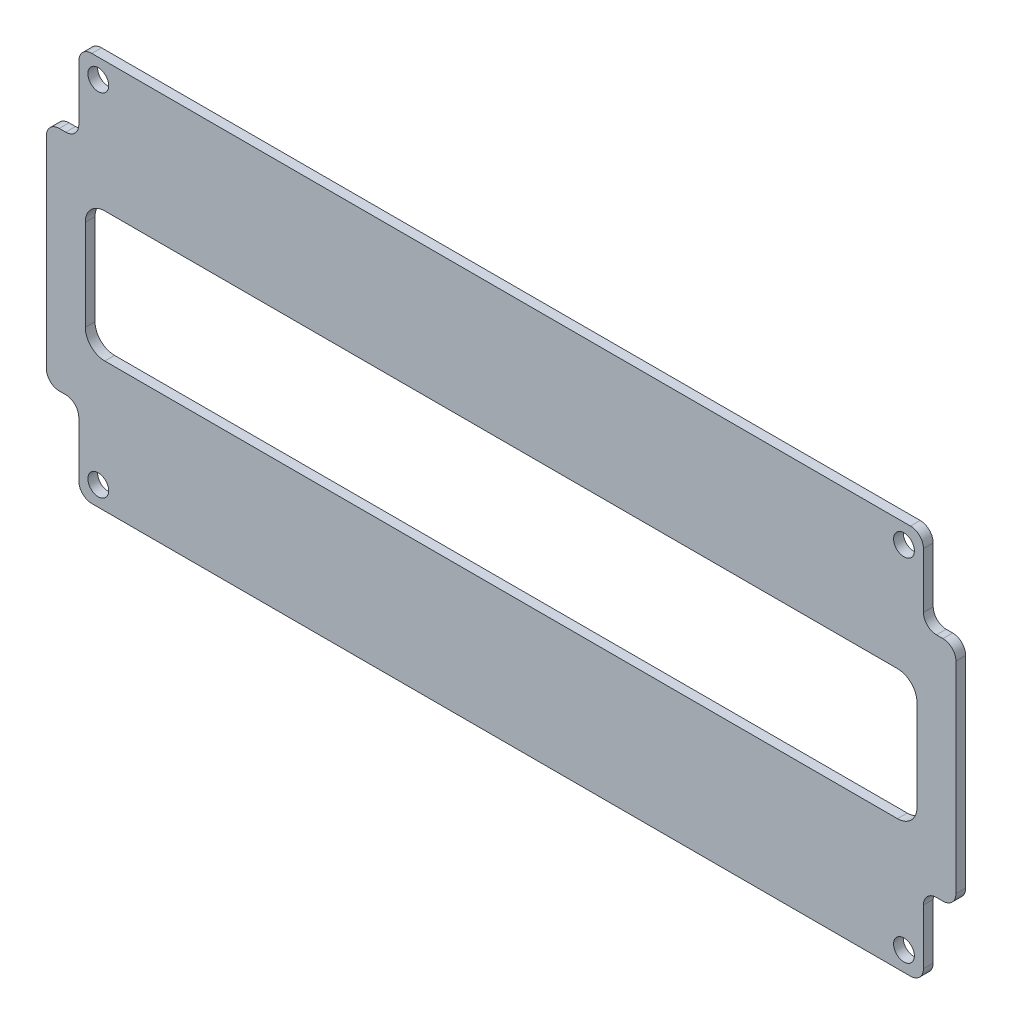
ISO-10303-21;
HEADER;
FILE_DESCRIPTION(('STEP AP214'),'2;1');
FILE_NAME('part.step','',(''),(''),'','','');
FILE_SCHEMA(('AUTOMOTIVE_DESIGN { 1 0 10303 214 1 1 1 1 }'));
ENDSEC;
DATA;
#1=APPLICATION_CONTEXT('core data for automotive mechanical design processes');
#2=APPLICATION_PROTOCOL_DEFINITION('international standard','automotive_design',2000,#1);
#3=PRODUCT_CONTEXT('',#1,'mechanical');
#4=PRODUCT('Part','Part','',(#3));
#5=PRODUCT_RELATED_PRODUCT_CATEGORY('part','',(#4));
#6=PRODUCT_DEFINITION_FORMATION('','',#4);
#7=PRODUCT_DEFINITION_CONTEXT('part definition',#1,'design');
#8=PRODUCT_DEFINITION('design','',#6,#7);
#9=PRODUCT_DEFINITION_SHAPE('','',#8);
#10=(LENGTH_UNIT() NAMED_UNIT(*) SI_UNIT(.MILLI.,.METRE.));
#11=(NAMED_UNIT(*) PLANE_ANGLE_UNIT() SI_UNIT($,.RADIAN.));
#12=(NAMED_UNIT(*) SI_UNIT($,.STERADIAN.) SOLID_ANGLE_UNIT());
#13=UNCERTAINTY_MEASURE_WITH_UNIT(LENGTH_MEASURE(1.E-05),#10,'distance_accuracy_value','');
#14=(GEOMETRIC_REPRESENTATION_CONTEXT(3) GLOBAL_UNCERTAINTY_ASSIGNED_CONTEXT((#13)) GLOBAL_UNIT_ASSIGNED_CONTEXT((#10,
#11,#12)) REPRESENTATION_CONTEXT('',''));
#15=CARTESIAN_POINT('',(0.,0.,0.));
#16=DIRECTION('',(0.,0.,1.));
#17=DIRECTION('',(1.,0.,0.));
#18=AXIS2_PLACEMENT_3D('',#15,#16,#17);
#19=CARTESIAN_POINT('',(63.,-28.,3.));
#20=DIRECTION('',(0.,0.,1.));
#21=DIRECTION('',(1.,0.,0.));
#22=AXIS2_PLACEMENT_3D('',#19,#20,#21);
#23=PLANE('',#22);
#24=CARTESIAN_POINT('',(62.,27.,3.));
#25=DIRECTION('',(0.,0.,1.));
#26=DIRECTION('',(1.,0.,0.));
#27=AXIS2_PLACEMENT_3D('',#24,#25,#26);
#28=CIRCLE('',#27,1.6);
#29=CARTESIAN_POINT('',(63.6,27.,3.));
#30=VERTEX_POINT('',#29);
#31=EDGE_CURVE('E933',#30,#30,#28,.T.);
#32=ORIENTED_EDGE('',*,*,#31,.F.);
#33=EDGE_LOOP('',(#32));
#34=FACE_BOUND('',#33,.T.);
#35=CARTESIAN_POINT('',(-62.,-27.,3.));
#36=DIRECTION('',(0.,0.,1.));
#37=DIRECTION('',(1.,0.,0.));
#38=AXIS2_PLACEMENT_3D('',#35,#36,#37);
#39=CIRCLE('',#38,1.6);
#40=CARTESIAN_POINT('',(-60.4,-27.,3.));
#41=VERTEX_POINT('',#40);
#42=EDGE_CURVE('E277',#41,#41,#39,.T.);
#43=ORIENTED_EDGE('',*,*,#42,.F.);
#44=EDGE_LOOP('',(#43));
#45=FACE_BOUND('',#44,.T.);
#46=CARTESIAN_POINT('',(63.,-28.,3.));
#47=DIRECTION('',(0.,0.,1.));
#48=DIRECTION('',(1.,0.,0.));
#49=AXIS2_PLACEMENT_3D('',#46,#47,#48);
#50=CIRCLE('',#49,1.99999999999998);
#51=CARTESIAN_POINT('',(63.,-30.,3.));
#52=VERTEX_POINT('',#51);
#53=CARTESIAN_POINT('',(64.9999999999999,-28.,3.));
#54=VERTEX_POINT('',#53);
#55=EDGE_CURVE('E307',#52,#54,#50,.T.);
#56=ORIENTED_EDGE('',*,*,#55,.T.);
#57=DIRECTION('',(0.,1.,0.));
#58=VECTOR('',#57,1.);
#59=CARTESIAN_POINT('',(64.9999999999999,-28.,3.));
#60=LINE('',#59,#58);
#61=CARTESIAN_POINT('',(64.9999999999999,-19.5,3.));
#62=VERTEX_POINT('',#61);
#63=EDGE_CURVE('E310',#54,#62,#60,.T.);
#64=ORIENTED_EDGE('',*,*,#63,.T.);
#65=CARTESIAN_POINT('',(67.,-19.5,3.));
#66=DIRECTION('',(0.,0.,-1.));
#67=DIRECTION('',(-1.,0.,0.));
#68=AXIS2_PLACEMENT_3D('',#65,#66,#67);
#69=CIRCLE('',#68,2.00000000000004);
#70=CARTESIAN_POINT('',(66.9999999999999,-17.5,3.));
#71=VERTEX_POINT('',#70);
#72=EDGE_CURVE('E313',#62,#71,#69,.T.);
#73=ORIENTED_EDGE('',*,*,#72,.T.);
#74=DIRECTION('',(1.,0.,0.));
#75=VECTOR('',#74,1.);
#76=CARTESIAN_POINT('',(66.9999999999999,-17.5,3.));
#77=LINE('',#76,#75);
#78=CARTESIAN_POINT('',(68.,-17.5,3.));
#79=VERTEX_POINT('',#78);
#80=EDGE_CURVE('E315',#71,#79,#77,.T.);
#81=ORIENTED_EDGE('',*,*,#80,.T.);
#82=CARTESIAN_POINT('',(68.,-15.5,3.));
#83=DIRECTION('',(0.,0.,1.));
#84=DIRECTION('',(1.,0.,0.));
#85=AXIS2_PLACEMENT_3D('',#82,#83,#84);
#86=CIRCLE('',#85,1.99999999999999);
#87=CARTESIAN_POINT('',(70.,-15.5,3.));
#88=VERTEX_POINT('',#87);
#89=EDGE_CURVE('E317',#79,#88,#86,.T.);
#90=ORIENTED_EDGE('',*,*,#89,.T.);
#91=DIRECTION('',(0.,1.,0.));
#92=VECTOR('',#91,1.);
#93=CARTESIAN_POINT('',(70.,15.5,3.));
#94=LINE('',#93,#92);
#95=CARTESIAN_POINT('',(70.,15.5,3.));
#96=VERTEX_POINT('',#95);
#97=EDGE_CURVE('E319',#88,#96,#94,.T.);
#98=ORIENTED_EDGE('',*,*,#97,.T.);
#99=CARTESIAN_POINT('',(68.,15.5,3.));
#100=DIRECTION('',(0.,0.,1.));
#101=DIRECTION('',(1.,0.,0.));
#102=AXIS2_PLACEMENT_3D('',#99,#100,#101);
#103=CIRCLE('',#102,1.99999999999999);
#104=CARTESIAN_POINT('',(68.,17.5,3.));
#105=VERTEX_POINT('',#104);
#106=EDGE_CURVE('E321',#96,#105,#103,.T.);
#107=ORIENTED_EDGE('',*,*,#106,.T.);
#108=DIRECTION('',(-1.,0.,0.));
#109=VECTOR('',#108,1.);
#110=CARTESIAN_POINT('',(66.9999999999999,17.5,3.));
#111=LINE('',#110,#109);
#112=CARTESIAN_POINT('',(66.9999999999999,17.5,3.));
#113=VERTEX_POINT('',#112);
#114=EDGE_CURVE('E323',#105,#113,#111,.T.);
#115=ORIENTED_EDGE('',*,*,#114,.T.);
#116=CARTESIAN_POINT('',(67.,19.5,3.));
#117=DIRECTION('',(0.,0.,-1.));
#118=DIRECTION('',(1.,0.,0.));
#119=AXIS2_PLACEMENT_3D('',#116,#117,#118);
#120=CIRCLE('',#119,2.00000000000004);
#121=CARTESIAN_POINT('',(64.9999999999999,19.5,3.));
#122=VERTEX_POINT('',#121);
#123=EDGE_CURVE('E325',#113,#122,#120,.T.);
#124=ORIENTED_EDGE('',*,*,#123,.T.);
#125=DIRECTION('',(0.,1.,0.));
#126=VECTOR('',#125,1.);
#127=CARTESIAN_POINT('',(64.9999999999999,28.,3.));
#128=LINE('',#127,#126);
#129=CARTESIAN_POINT('',(65.,28.,3.));
#130=VERTEX_POINT('',#129);
#131=EDGE_CURVE('E327',#122,#130,#128,.T.);
#132=ORIENTED_EDGE('',*,*,#131,.T.);
#133=CARTESIAN_POINT('',(63.,28.,3.));
#134=DIRECTION('',(0.,0.,1.));
#135=DIRECTION('',(-1.,0.,0.));
#136=AXIS2_PLACEMENT_3D('',#133,#134,#135);
#137=CIRCLE('',#136,1.99999999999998);
#138=CARTESIAN_POINT('',(63.,30.,3.));
#139=VERTEX_POINT('',#138);
#140=EDGE_CURVE('E329',#130,#139,#137,.T.);
#141=ORIENTED_EDGE('',*,*,#140,.T.);
#142=DIRECTION('',(-1.,0.,0.));
#143=VECTOR('',#142,1.);
#144=CARTESIAN_POINT('',(-63.,30.,3.));
#145=LINE('',#144,#143);
#146=CARTESIAN_POINT('',(-63.,30.,3.));
#147=VERTEX_POINT('',#146);
#148=EDGE_CURVE('E331',#139,#147,#145,.T.);
#149=ORIENTED_EDGE('',*,*,#148,.T.);
#150=CARTESIAN_POINT('',(-63.,28.,3.));
#151=DIRECTION('',(0.,0.,1.));
#152=DIRECTION('',(1.,0.,0.));
#153=AXIS2_PLACEMENT_3D('',#150,#151,#152);
#154=CIRCLE('',#153,1.99999999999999);
#155=CARTESIAN_POINT('',(-65.,28.,3.));
#156=VERTEX_POINT('',#155);
#157=EDGE_CURVE('E333',#147,#156,#154,.T.);
#158=ORIENTED_EDGE('',*,*,#157,.T.);
#159=DIRECTION('',(0.,-1.,0.));
#160=VECTOR('',#159,1.);
#161=CARTESIAN_POINT('',(-65.,28.,3.));
#162=LINE('',#161,#160);
#163=CARTESIAN_POINT('',(-65.,19.5,3.));
#164=VERTEX_POINT('',#163);
#165=EDGE_CURVE('E335',#156,#164,#162,.T.);
#166=ORIENTED_EDGE('',*,*,#165,.T.);
#167=CARTESIAN_POINT('',(-67.,19.5,3.));
#168=DIRECTION('',(0.,0.,-1.));
#169=DIRECTION('',(-1.,0.,0.));
#170=AXIS2_PLACEMENT_3D('',#167,#168,#169);
#171=CIRCLE('',#170,2.00000000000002);
#172=CARTESIAN_POINT('',(-66.9999999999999,17.5,3.));
#173=VERTEX_POINT('',#172);
#174=EDGE_CURVE('E337',#164,#173,#171,.T.);
#175=ORIENTED_EDGE('',*,*,#174,.T.);
#176=DIRECTION('',(-1.,0.,0.));
#177=VECTOR('',#176,1.);
#178=CARTESIAN_POINT('',(-66.9999999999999,17.5,3.));
#179=LINE('',#178,#177);
#180=CARTESIAN_POINT('',(-68.,17.5,3.));
#181=VERTEX_POINT('',#180);
#182=EDGE_CURVE('E339',#173,#181,#179,.T.);
#183=ORIENTED_EDGE('',*,*,#182,.T.);
#184=CARTESIAN_POINT('',(-68.,15.5,3.));
#185=DIRECTION('',(0.,0.,1.));
#186=DIRECTION('',(-1.,0.,0.));
#187=AXIS2_PLACEMENT_3D('',#184,#185,#186);
#188=CIRCLE('',#187,2.00000000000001);
#189=CARTESIAN_POINT('',(-70.,15.5,3.));
#190=VERTEX_POINT('',#189);
#191=EDGE_CURVE('E341',#181,#190,#188,.T.);
#192=ORIENTED_EDGE('',*,*,#191,.T.);
#193=DIRECTION('',(0.,-1.,0.));
#194=VECTOR('',#193,1.);
#195=CARTESIAN_POINT('',(-70.,15.5,3.));
#196=LINE('',#195,#194);
#197=CARTESIAN_POINT('',(-70.,-15.5,3.));
#198=VERTEX_POINT('',#197);
#199=EDGE_CURVE('E343',#190,#198,#196,.T.);
#200=ORIENTED_EDGE('',*,*,#199,.T.);
#201=CARTESIAN_POINT('',(-68.,-15.5,3.));
#202=DIRECTION('',(0.,0.,1.));
#203=DIRECTION('',(-1.,0.,0.));
#204=AXIS2_PLACEMENT_3D('',#201,#202,#203);
#205=CIRCLE('',#204,2.00000000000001);
#206=CARTESIAN_POINT('',(-68.,-17.5,3.));
#207=VERTEX_POINT('',#206);
#208=EDGE_CURVE('E345',#198,#207,#205,.T.);
#209=ORIENTED_EDGE('',*,*,#208,.T.);
#210=DIRECTION('',(1.,0.,0.));
#211=VECTOR('',#210,1.);
#212=CARTESIAN_POINT('',(-66.9999999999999,-17.5,3.));
#213=LINE('',#212,#211);
#214=CARTESIAN_POINT('',(-66.9999999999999,-17.5,3.));
#215=VERTEX_POINT('',#214);
#216=EDGE_CURVE('E347',#207,#215,#213,.T.);
#217=ORIENTED_EDGE('',*,*,#216,.T.);
#218=CARTESIAN_POINT('',(-67.,-19.5,3.));
#219=DIRECTION('',(0.,0.,-1.));
#220=DIRECTION('',(1.,0.,0.));
#221=AXIS2_PLACEMENT_3D('',#218,#219,#220);
#222=CIRCLE('',#221,2.00000000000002);
#223=CARTESIAN_POINT('',(-65.,-19.5,3.));
#224=VERTEX_POINT('',#223);
#225=EDGE_CURVE('E349',#215,#224,#222,.T.);
#226=ORIENTED_EDGE('',*,*,#225,.T.);
#227=DIRECTION('',(0.,-1.,0.));
#228=VECTOR('',#227,1.);
#229=CARTESIAN_POINT('',(-65.,-28.,3.));
#230=LINE('',#229,#228);
#231=CARTESIAN_POINT('',(-65.,-28.,3.));
#232=VERTEX_POINT('',#231);
#233=EDGE_CURVE('E351',#224,#232,#230,.T.);
#234=ORIENTED_EDGE('',*,*,#233,.T.);
#235=CARTESIAN_POINT('',(-63.,-28.,3.));
#236=DIRECTION('',(0.,0.,1.));
#237=DIRECTION('',(-1.,0.,0.));
#238=AXIS2_PLACEMENT_3D('',#235,#236,#237);
#239=CIRCLE('',#238,1.99999999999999);
#240=CARTESIAN_POINT('',(-63.,-30.,3.));
#241=VERTEX_POINT('',#240);
#242=EDGE_CURVE('E353',#232,#241,#239,.T.);
#243=ORIENTED_EDGE('',*,*,#242,.T.);
#244=DIRECTION('',(1.,0.,0.));
#245=VECTOR('',#244,1.);
#246=CARTESIAN_POINT('',(-63.,-30.,3.));
#247=LINE('',#246,#245);
#248=EDGE_CURVE('E355',#241,#52,#247,.T.);
#249=ORIENTED_EDGE('',*,*,#248,.T.);
#250=EDGE_LOOP('',(#56,#64,#73,#81,#90,#98,#107,#115,#124,#132,#141,#149,#158,#166,#175,#183,
#192,#200,#209,#217,#226,#234,#243,#249));
#251=FACE_BOUND('',#250,.T.);
#252=DIRECTION('',(1.,0.,0.));
#253=VECTOR('',#252,1.);
#254=CARTESIAN_POINT('',(-61.,-10.,3.));
#255=LINE('',#254,#253);
#256=CARTESIAN_POINT('',(-61.,-10.,3.));
#257=VERTEX_POINT('',#256);
#258=CARTESIAN_POINT('',(61.,-9.99999999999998,3.));
#259=VERTEX_POINT('',#258);
#260=EDGE_CURVE('E247',#257,#259,#255,.T.);
#261=ORIENTED_EDGE('',*,*,#260,.F.);
#262=CARTESIAN_POINT('',(-61.,-7.,3.));
#263=DIRECTION('',(0.,0.,1.));
#264=DIRECTION('',(1.,0.,0.));
#265=AXIS2_PLACEMENT_3D('',#262,#263,#264);
#266=CIRCLE('',#265,3.);
#267=CARTESIAN_POINT('',(-64.,-6.99999999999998,3.));
#268=VERTEX_POINT('',#267);
#269=EDGE_CURVE('E239',#268,#257,#266,.T.);
#270=ORIENTED_EDGE('',*,*,#269,.F.);
#271=DIRECTION('',(0.,-1.,0.));
#272=VECTOR('',#271,1.);
#273=CARTESIAN_POINT('',(-64.,6.99999999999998,3.));
#274=LINE('',#273,#272);
#275=CARTESIAN_POINT('',(-64.,6.99999999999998,3.));
#276=VERTEX_POINT('',#275);
#277=EDGE_CURVE('E274',#276,#268,#274,.T.);
#278=ORIENTED_EDGE('',*,*,#277,.F.);
#279=CARTESIAN_POINT('',(-61.,7.,3.));
#280=DIRECTION('',(0.,0.,1.));
#281=DIRECTION('',(1.,0.,0.));
#282=AXIS2_PLACEMENT_3D('',#279,#280,#281);
#283=CIRCLE('',#282,3.);
#284=CARTESIAN_POINT('',(-61.,10.,3.));
#285=VERTEX_POINT('',#284);
#286=EDGE_CURVE('E272',#285,#276,#283,.T.);
#287=ORIENTED_EDGE('',*,*,#286,.F.);
#288=DIRECTION('',(-1.,0.,0.));
#289=VECTOR('',#288,1.);
#290=CARTESIAN_POINT('',(-61.,10.,3.));
#291=LINE('',#290,#289);
#292=CARTESIAN_POINT('',(61.,10.,3.));
#293=VERTEX_POINT('',#292);
#294=EDGE_CURVE('E270',#293,#285,#291,.T.);
#295=ORIENTED_EDGE('',*,*,#294,.F.);
#296=CARTESIAN_POINT('',(61.,7.00000000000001,3.));
#297=DIRECTION('',(0.,0.,1.));
#298=DIRECTION('',(-1.,0.,0.));
#299=AXIS2_PLACEMENT_3D('',#296,#297,#298);
#300=CIRCLE('',#299,3.);
#301=CARTESIAN_POINT('',(64.,6.99999999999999,3.));
#302=VERTEX_POINT('',#301);
#303=EDGE_CURVE('E268',#302,#293,#300,.T.);
#304=ORIENTED_EDGE('',*,*,#303,.F.);
#305=DIRECTION('',(0.,1.,0.));
#306=VECTOR('',#305,1.);
#307=CARTESIAN_POINT('',(64.,6.99999999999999,3.));
#308=LINE('',#307,#306);
#309=CARTESIAN_POINT('',(64.,-6.99999999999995,3.));
#310=VERTEX_POINT('',#309);
#311=EDGE_CURVE('E263',#310,#302,#308,.T.);
#312=ORIENTED_EDGE('',*,*,#311,.F.);
#313=CARTESIAN_POINT('',(61.,-6.99999999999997,3.));
#314=DIRECTION('',(0.,0.,1.));
#315=DIRECTION('',(-1.,0.,0.));
#316=AXIS2_PLACEMENT_3D('',#313,#314,#315);
#317=CIRCLE('',#316,3.00000000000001);
#318=EDGE_CURVE('E261',#259,#310,#317,.T.);
#319=ORIENTED_EDGE('',*,*,#318,.F.);
#320=EDGE_LOOP('',(#261,#270,#278,#287,#295,#304,#312,#319));
#321=FACE_BOUND('',#320,.T.);
#322=CARTESIAN_POINT('',(-62.,27.,3.));
#323=DIRECTION('',(0.,0.,1.));
#324=DIRECTION('',(-1.,0.,0.));
#325=AXIS2_PLACEMENT_3D('',#322,#323,#324);
#326=CIRCLE('',#325,1.6);
#327=CARTESIAN_POINT('',(-63.6,27.,3.));
#328=VERTEX_POINT('',#327);
#329=EDGE_CURVE('E939',#328,#328,#326,.T.);
#330=ORIENTED_EDGE('',*,*,#329,.F.);
#331=EDGE_LOOP('',(#330));
#332=FACE_BOUND('',#331,.T.);
#333=CARTESIAN_POINT('',(62.,-27.,3.));
#334=DIRECTION('',(0.,0.,1.));
#335=DIRECTION('',(-1.,0.,0.));
#336=AXIS2_PLACEMENT_3D('',#333,#334,#335);
#337=CIRCLE('',#336,1.6);
#338=CARTESIAN_POINT('',(60.4,-27.,3.));
#339=VERTEX_POINT('',#338);
#340=EDGE_CURVE('E924',#339,#339,#337,.T.);
#341=ORIENTED_EDGE('',*,*,#340,.F.);
#342=EDGE_LOOP('',(#341));
#343=FACE_BOUND('',#342,.T.);
#344=ADVANCED_FACE('F30',(#34,#45,#251,#321,#332,#343),#23,.T.);
#345=CARTESIAN_POINT('',(63.,-28.,1.5));
#346=DIRECTION('',(0.,0.,1.));
#347=DIRECTION('',(1.,0.,0.));
#348=AXIS2_PLACEMENT_3D('',#345,#346,#347);
#349=PLANE('',#348);
#350=CARTESIAN_POINT('',(63.,-28.,1.5));
#351=DIRECTION('',(0.,0.,1.));
#352=DIRECTION('',(1.,0.,0.));
#353=AXIS2_PLACEMENT_3D('',#350,#351,#352);
#354=CIRCLE('',#353,1.99999999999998);
#355=CARTESIAN_POINT('',(63.,-30.,1.5));
#356=VERTEX_POINT('',#355);
#357=CARTESIAN_POINT('',(64.9999999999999,-28.,1.5));
#358=VERTEX_POINT('',#357);
#359=EDGE_CURVE('E255',#356,#358,#354,.T.);
#360=ORIENTED_EDGE('',*,*,#359,.F.);
#361=DIRECTION('',(1.,0.,0.));
#362=VECTOR('',#361,1.);
#363=CARTESIAN_POINT('',(-63.,-30.,1.5));
#364=LINE('',#363,#362);
#365=CARTESIAN_POINT('',(-63.,-30.,1.5));
#366=VERTEX_POINT('',#365);
#367=EDGE_CURVE('E311',#366,#356,#364,.T.);
#368=ORIENTED_EDGE('',*,*,#367,.F.);
#369=CARTESIAN_POINT('',(-63.,-28.,1.5));
#370=DIRECTION('',(0.,0.,1.));
#371=DIRECTION('',(-1.,0.,0.));
#372=AXIS2_PLACEMENT_3D('',#369,#370,#371);
#373=CIRCLE('',#372,1.99999999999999);
#374=CARTESIAN_POINT('',(-65.,-28.,1.5));
#375=VERTEX_POINT('',#374);
#376=EDGE_CURVE('E402',#375,#366,#373,.T.);
#377=ORIENTED_EDGE('',*,*,#376,.F.);
#378=DIRECTION('',(0.,-1.,0.));
#379=VECTOR('',#378,1.);
#380=CARTESIAN_POINT('',(-65.,-28.,1.5));
#381=LINE('',#380,#379);
#382=CARTESIAN_POINT('',(-65.,-19.5,1.5));
#383=VERTEX_POINT('',#382);
#384=EDGE_CURVE('E400',#383,#375,#381,.T.);
#385=ORIENTED_EDGE('',*,*,#384,.F.);
#386=CARTESIAN_POINT('',(-67.,-19.5,1.5));
#387=DIRECTION('',(0.,0.,-1.));
#388=DIRECTION('',(1.,0.,0.));
#389=AXIS2_PLACEMENT_3D('',#386,#387,#388);
#390=CIRCLE('',#389,2.00000000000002);
#391=CARTESIAN_POINT('',(-66.9999999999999,-17.5,1.5));
#392=VERTEX_POINT('',#391);
#393=EDGE_CURVE('E398',#392,#383,#390,.T.);
#394=ORIENTED_EDGE('',*,*,#393,.F.);
#395=DIRECTION('',(1.,0.,0.));
#396=VECTOR('',#395,1.);
#397=CARTESIAN_POINT('',(-66.9999999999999,-17.5,1.5));
#398=LINE('',#397,#396);
#399=CARTESIAN_POINT('',(-68.,-17.5,1.5));
#400=VERTEX_POINT('',#399);
#401=EDGE_CURVE('E396',#400,#392,#398,.T.);
#402=ORIENTED_EDGE('',*,*,#401,.F.);
#403=CARTESIAN_POINT('',(-68.,-15.5,1.5));
#404=DIRECTION('',(0.,0.,1.));
#405=DIRECTION('',(-1.,0.,0.));
#406=AXIS2_PLACEMENT_3D('',#403,#404,#405);
#407=CIRCLE('',#406,2.00000000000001);
#408=CARTESIAN_POINT('',(-70.,-15.5,1.5));
#409=VERTEX_POINT('',#408);
#410=EDGE_CURVE('E394',#409,#400,#407,.T.);
#411=ORIENTED_EDGE('',*,*,#410,.F.);
#412=DIRECTION('',(0.,-1.,0.));
#413=VECTOR('',#412,1.);
#414=CARTESIAN_POINT('',(-70.,15.5,1.5));
#415=LINE('',#414,#413);
#416=CARTESIAN_POINT('',(-70.,15.5,1.5));
#417=VERTEX_POINT('',#416);
#418=EDGE_CURVE('E392',#417,#409,#415,.T.);
#419=ORIENTED_EDGE('',*,*,#418,.F.);
#420=CARTESIAN_POINT('',(-68.,15.5,1.5));
#421=DIRECTION('',(0.,0.,1.));
#422=DIRECTION('',(-1.,0.,0.));
#423=AXIS2_PLACEMENT_3D('',#420,#421,#422);
#424=CIRCLE('',#423,2.00000000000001);
#425=CARTESIAN_POINT('',(-68.,17.5,1.5));
#426=VERTEX_POINT('',#425);
#427=EDGE_CURVE('E390',#426,#417,#424,.T.);
#428=ORIENTED_EDGE('',*,*,#427,.F.);
#429=DIRECTION('',(-1.,0.,0.));
#430=VECTOR('',#429,1.);
#431=CARTESIAN_POINT('',(-66.9999999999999,17.5,1.5));
#432=LINE('',#431,#430);
#433=CARTESIAN_POINT('',(-66.9999999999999,17.5,1.5));
#434=VERTEX_POINT('',#433);
#435=EDGE_CURVE('E388',#434,#426,#432,.T.);
#436=ORIENTED_EDGE('',*,*,#435,.F.);
#437=CARTESIAN_POINT('',(-67.,19.5,1.5));
#438=DIRECTION('',(0.,0.,-1.));
#439=DIRECTION('',(-1.,0.,0.));
#440=AXIS2_PLACEMENT_3D('',#437,#438,#439);
#441=CIRCLE('',#440,2.00000000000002);
#442=CARTESIAN_POINT('',(-65.,19.5,1.5));
#443=VERTEX_POINT('',#442);
#444=EDGE_CURVE('E386',#443,#434,#441,.T.);
#445=ORIENTED_EDGE('',*,*,#444,.F.);
#446=DIRECTION('',(0.,-1.,0.));
#447=VECTOR('',#446,1.);
#448=CARTESIAN_POINT('',(-65.,28.,1.5));
#449=LINE('',#448,#447);
#450=CARTESIAN_POINT('',(-65.,28.,1.5));
#451=VERTEX_POINT('',#450);
#452=EDGE_CURVE('E384',#451,#443,#449,.T.);
#453=ORIENTED_EDGE('',*,*,#452,.F.);
#454=CARTESIAN_POINT('',(-63.,28.,1.5));
#455=DIRECTION('',(0.,0.,1.));
#456=DIRECTION('',(1.,0.,0.));
#457=AXIS2_PLACEMENT_3D('',#454,#455,#456);
#458=CIRCLE('',#457,1.99999999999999);
#459=CARTESIAN_POINT('',(-63.,30.,1.5));
#460=VERTEX_POINT('',#459);
#461=EDGE_CURVE('E382',#460,#451,#458,.T.);
#462=ORIENTED_EDGE('',*,*,#461,.F.);
#463=DIRECTION('',(-1.,0.,0.));
#464=VECTOR('',#463,1.);
#465=CARTESIAN_POINT('',(-63.,30.,1.5));
#466=LINE('',#465,#464);
#467=CARTESIAN_POINT('',(63.,30.,1.5));
#468=VERTEX_POINT('',#467);
#469=EDGE_CURVE('E380',#468,#460,#466,.T.);
#470=ORIENTED_EDGE('',*,*,#469,.F.);
#471=CARTESIAN_POINT('',(63.,28.,1.5));
#472=DIRECTION('',(0.,0.,1.));
#473=DIRECTION('',(-1.,0.,0.));
#474=AXIS2_PLACEMENT_3D('',#471,#472,#473);
#475=CIRCLE('',#474,1.99999999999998);
#476=CARTESIAN_POINT('',(65.,28.,1.5));
#477=VERTEX_POINT('',#476);
#478=EDGE_CURVE('E378',#477,#468,#475,.T.);
#479=ORIENTED_EDGE('',*,*,#478,.F.);
#480=DIRECTION('',(0.,1.,0.));
#481=VECTOR('',#480,1.);
#482=CARTESIAN_POINT('',(64.9999999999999,28.,1.5));
#483=LINE('',#482,#481);
#484=CARTESIAN_POINT('',(64.9999999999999,19.5,1.5));
#485=VERTEX_POINT('',#484);
#486=EDGE_CURVE('E376',#485,#477,#483,.T.);
#487=ORIENTED_EDGE('',*,*,#486,.F.);
#488=CARTESIAN_POINT('',(67.,19.5,1.5));
#489=DIRECTION('',(0.,0.,-1.));
#490=DIRECTION('',(1.,0.,0.));
#491=AXIS2_PLACEMENT_3D('',#488,#489,#490);
#492=CIRCLE('',#491,2.00000000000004);
#493=CARTESIAN_POINT('',(66.9999999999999,17.5,1.5));
#494=VERTEX_POINT('',#493);
#495=EDGE_CURVE('E374',#494,#485,#492,.T.);
#496=ORIENTED_EDGE('',*,*,#495,.F.);
#497=DIRECTION('',(-1.,0.,0.));
#498=VECTOR('',#497,1.);
#499=CARTESIAN_POINT('',(66.9999999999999,17.5,1.5));
#500=LINE('',#499,#498);
#501=CARTESIAN_POINT('',(68.,17.5,1.5));
#502=VERTEX_POINT('',#501);
#503=EDGE_CURVE('E372',#502,#494,#500,.T.);
#504=ORIENTED_EDGE('',*,*,#503,.F.);
#505=CARTESIAN_POINT('',(68.,15.5,1.5));
#506=DIRECTION('',(0.,0.,1.));
#507=DIRECTION('',(1.,0.,0.));
#508=AXIS2_PLACEMENT_3D('',#505,#506,#507);
#509=CIRCLE('',#508,1.99999999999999);
#510=CARTESIAN_POINT('',(70.,15.5,1.5));
#511=VERTEX_POINT('',#510);
#512=EDGE_CURVE('E370',#511,#502,#509,.T.);
#513=ORIENTED_EDGE('',*,*,#512,.F.);
#514=DIRECTION('',(0.,1.,0.));
#515=VECTOR('',#514,1.);
#516=CARTESIAN_POINT('',(70.,15.5,1.5));
#517=LINE('',#516,#515);
#518=CARTESIAN_POINT('',(70.,-15.5,1.5));
#519=VERTEX_POINT('',#518);
#520=EDGE_CURVE('E368',#519,#511,#517,.T.);
#521=ORIENTED_EDGE('',*,*,#520,.F.);
#522=CARTESIAN_POINT('',(68.,-15.5,1.5));
#523=DIRECTION('',(0.,0.,1.));
#524=DIRECTION('',(1.,0.,0.));
#525=AXIS2_PLACEMENT_3D('',#522,#523,#524);
#526=CIRCLE('',#525,1.99999999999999);
#527=CARTESIAN_POINT('',(68.,-17.5,1.5));
#528=VERTEX_POINT('',#527);
#529=EDGE_CURVE('E366',#528,#519,#526,.T.);
#530=ORIENTED_EDGE('',*,*,#529,.F.);
#531=DIRECTION('',(1.,0.,0.));
#532=VECTOR('',#531,1.);
#533=CARTESIAN_POINT('',(66.9999999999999,-17.5,1.5));
#534=LINE('',#533,#532);
#535=CARTESIAN_POINT('',(66.9999999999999,-17.5,1.5));
#536=VERTEX_POINT('',#535);
#537=EDGE_CURVE('E364',#536,#528,#534,.T.);
#538=ORIENTED_EDGE('',*,*,#537,.F.);
#539=CARTESIAN_POINT('',(67.,-19.5,1.5));
#540=DIRECTION('',(0.,0.,-1.));
#541=DIRECTION('',(-1.,0.,0.));
#542=AXIS2_PLACEMENT_3D('',#539,#540,#541);
#543=CIRCLE('',#542,2.00000000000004);
#544=CARTESIAN_POINT('',(64.9999999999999,-19.5,1.5));
#545=VERTEX_POINT('',#544);
#546=EDGE_CURVE('E362',#545,#536,#543,.T.);
#547=ORIENTED_EDGE('',*,*,#546,.F.);
#548=DIRECTION('',(0.,1.,0.));
#549=VECTOR('',#548,1.);
#550=CARTESIAN_POINT('',(64.9999999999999,-28.,1.5));
#551=LINE('',#550,#549);
#552=EDGE_CURVE('E360',#358,#545,#551,.T.);
#553=ORIENTED_EDGE('',*,*,#552,.F.);
#554=EDGE_LOOP('',(#360,#368,#377,#385,#394,#402,#411,#419,#428,#436,#445,#453,#462,#470,#479,
#487,#496,#504,#513,#521,#530,#538,#547,#553));
#555=FACE_BOUND('',#554,.T.);
#556=CARTESIAN_POINT('',(-61.,-7.,1.5));
#557=DIRECTION('',(0.,0.,1.));
#558=DIRECTION('',(1.,0.,0.));
#559=AXIS2_PLACEMENT_3D('',#556,#557,#558);
#560=CIRCLE('',#559,3.);
#561=CARTESIAN_POINT('',(-64.,-6.99999999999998,1.5));
#562=VERTEX_POINT('',#561);
#563=CARTESIAN_POINT('',(-61.,-10.,1.5));
#564=VERTEX_POINT('',#563);
#565=EDGE_CURVE('E53',#562,#564,#560,.T.);
#566=ORIENTED_EDGE('',*,*,#565,.T.);
#567=DIRECTION('',(1.,0.,0.));
#568=VECTOR('',#567,1.);
#569=CARTESIAN_POINT('',(-61.,-10.,1.5));
#570=LINE('',#569,#568);
#571=CARTESIAN_POINT('',(61.,-9.99999999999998,1.5));
#572=VERTEX_POINT('',#571);
#573=EDGE_CURVE('E254',#564,#572,#570,.T.);
#574=ORIENTED_EDGE('',*,*,#573,.T.);
#575=CARTESIAN_POINT('',(61.,-6.99999999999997,1.5));
#576=DIRECTION('',(0.,0.,1.));
#577=DIRECTION('',(-1.,0.,0.));
#578=AXIS2_PLACEMENT_3D('',#575,#576,#577);
#579=CIRCLE('',#578,3.00000000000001);
#580=CARTESIAN_POINT('',(64.,-6.99999999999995,1.5));
#581=VERTEX_POINT('',#580);
#582=EDGE_CURVE('E279',#572,#581,#579,.T.);
#583=ORIENTED_EDGE('',*,*,#582,.T.);
#584=DIRECTION('',(0.,1.,0.));
#585=VECTOR('',#584,1.);
#586=CARTESIAN_POINT('',(64.,6.99999999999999,1.5));
#587=LINE('',#586,#585);
#588=CARTESIAN_POINT('',(64.,6.99999999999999,1.5));
#589=VERTEX_POINT('',#588);
#590=EDGE_CURVE('E282',#581,#589,#587,.T.);
#591=ORIENTED_EDGE('',*,*,#590,.T.);
#592=CARTESIAN_POINT('',(61.,7.00000000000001,1.5));
#593=DIRECTION('',(0.,0.,1.));
#594=DIRECTION('',(-1.,0.,0.));
#595=AXIS2_PLACEMENT_3D('',#592,#593,#594);
#596=CIRCLE('',#595,3.);
#597=CARTESIAN_POINT('',(61.,10.,1.5));
#598=VERTEX_POINT('',#597);
#599=EDGE_CURVE('E285',#589,#598,#596,.T.);
#600=ORIENTED_EDGE('',*,*,#599,.T.);
#601=DIRECTION('',(-1.,0.,0.));
#602=VECTOR('',#601,1.);
#603=CARTESIAN_POINT('',(-61.,10.,1.5));
#604=LINE('',#603,#602);
#605=CARTESIAN_POINT('',(-61.,10.,1.5));
#606=VERTEX_POINT('',#605);
#607=EDGE_CURVE('E288',#598,#606,#604,.T.);
#608=ORIENTED_EDGE('',*,*,#607,.T.);
#609=CARTESIAN_POINT('',(-61.,7.,1.5));
#610=DIRECTION('',(0.,0.,1.));
#611=DIRECTION('',(1.,0.,0.));
#612=AXIS2_PLACEMENT_3D('',#609,#610,#611);
#613=CIRCLE('',#612,3.);
#614=CARTESIAN_POINT('',(-64.,6.99999999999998,1.5));
#615=VERTEX_POINT('',#614);
#616=EDGE_CURVE('E291',#606,#615,#613,.T.);
#617=ORIENTED_EDGE('',*,*,#616,.T.);
#618=DIRECTION('',(0.,-1.,0.));
#619=VECTOR('',#618,1.);
#620=CARTESIAN_POINT('',(-64.,6.99999999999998,1.5));
#621=LINE('',#620,#619);
#622=EDGE_CURVE('E248',#615,#562,#621,.T.);
#623=ORIENTED_EDGE('',*,*,#622,.T.);
#624=EDGE_LOOP('',(#566,#574,#583,#591,#600,#608,#617,#623));
#625=FACE_BOUND('',#624,.T.);
#626=CARTESIAN_POINT('',(-62.,-27.,1.5));
#627=DIRECTION('',(0.,0.,1.));
#628=DIRECTION('',(1.,0.,0.));
#629=AXIS2_PLACEMENT_3D('',#626,#627,#628);
#630=CIRCLE('',#629,1.6);
#631=CARTESIAN_POINT('',(-60.4,-27.,1.5));
#632=VERTEX_POINT('',#631);
#633=EDGE_CURVE('E942',#632,#632,#630,.T.);
#634=ORIENTED_EDGE('',*,*,#633,.T.);
#635=EDGE_LOOP('',(#634));
#636=FACE_BOUND('',#635,.T.);
#637=CARTESIAN_POINT('',(-62.,27.,1.5));
#638=DIRECTION('',(0.,0.,1.));
#639=DIRECTION('',(-1.,0.,0.));
#640=AXIS2_PLACEMENT_3D('',#637,#638,#639);
#641=CIRCLE('',#640,1.6);
#642=CARTESIAN_POINT('',(-63.6,27.,1.5));
#643=VERTEX_POINT('',#642);
#644=EDGE_CURVE('E936',#643,#643,#641,.T.);
#645=ORIENTED_EDGE('',*,*,#644,.T.);
#646=EDGE_LOOP('',(#645));
#647=FACE_BOUND('',#646,.T.);
#648=CARTESIAN_POINT('',(62.,27.,1.5));
#649=DIRECTION('',(0.,0.,1.));
#650=DIRECTION('',(1.,0.,0.));
#651=AXIS2_PLACEMENT_3D('',#648,#649,#650);
#652=CIRCLE('',#651,1.6);
#653=CARTESIAN_POINT('',(63.6,27.,1.5));
#654=VERTEX_POINT('',#653);
#655=EDGE_CURVE('E930',#654,#654,#652,.T.);
#656=ORIENTED_EDGE('',*,*,#655,.T.);
#657=EDGE_LOOP('',(#656));
#658=FACE_BOUND('',#657,.T.);
#659=CARTESIAN_POINT('',(62.,-27.,1.5));
#660=DIRECTION('',(0.,0.,1.));
#661=DIRECTION('',(-1.,0.,0.));
#662=AXIS2_PLACEMENT_3D('',#659,#660,#661);
#663=CIRCLE('',#662,1.6);
#664=CARTESIAN_POINT('',(60.4,-27.,1.5));
#665=VERTEX_POINT('',#664);
#666=EDGE_CURVE('E927',#665,#665,#663,.T.);
#667=ORIENTED_EDGE('',*,*,#666,.T.);
#668=EDGE_LOOP('',(#667));
#669=FACE_BOUND('',#668,.T.);
#670=ADVANCED_FACE('F480',(#555,#625,#636,#647,#658,#669),#349,.F.);
#671=CARTESIAN_POINT('',(63.,-28.,3.));
#672=DIRECTION('',(0.,0.,-1.));
#673=DIRECTION('',(-1.,0.,0.));
#674=AXIS2_PLACEMENT_3D('',#671,#672,#673);
#675=CYLINDRICAL_SURFACE('',#674,1.99999999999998);
#676=ORIENTED_EDGE('',*,*,#359,.T.);
#677=DIRECTION('',(0.,0.,-1.));
#678=VECTOR('',#677,1.);
#679=CARTESIAN_POINT('',(64.9999999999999,-28.,3.));
#680=LINE('',#679,#678);
#681=EDGE_CURVE('E11',#54,#358,#680,.T.);
#682=ORIENTED_EDGE('',*,*,#681,.F.);
#683=ORIENTED_EDGE('',*,*,#55,.F.);
#684=DIRECTION('',(0.,0.,-1.));
#685=VECTOR('',#684,1.);
#686=CARTESIAN_POINT('',(63.,-30.,3.));
#687=LINE('',#686,#685);
#688=EDGE_CURVE('E357',#52,#356,#687,.T.);
#689=ORIENTED_EDGE('',*,*,#688,.T.);
#690=EDGE_LOOP('',(#676,#682,#683,#689));
#691=FACE_BOUND('',#690,.T.);
#692=ADVANCED_FACE('F32',(#691),#675,.T.);
#693=CARTESIAN_POINT('',(64.9999999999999,-28.,3.));
#694=DIRECTION('',(-1.,0.,0.));
#695=DIRECTION('',(0.,0.,1.));
#696=AXIS2_PLACEMENT_3D('',#693,#694,#695);
#697=PLANE('',#696);
#698=ORIENTED_EDGE('',*,*,#552,.T.);
#699=DIRECTION('',(0.,0.,-1.));
#700=VECTOR('',#699,1.);
#701=CARTESIAN_POINT('',(64.9999999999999,-19.5,3.));
#702=LINE('',#701,#700);
#703=EDGE_CURVE('E38',#62,#545,#702,.T.);
#704=ORIENTED_EDGE('',*,*,#703,.F.);
#705=ORIENTED_EDGE('',*,*,#63,.F.);
#706=ORIENTED_EDGE('',*,*,#681,.T.);
#707=EDGE_LOOP('',(#698,#704,#705,#706));
#708=FACE_BOUND('',#707,.T.);
#709=ADVANCED_FACE('F497',(#708),#697,.F.);
#710=CARTESIAN_POINT('',(67.,-19.5,3.));
#711=DIRECTION('',(0.,0.,-1.));
#712=DIRECTION('',(-1.,0.,0.));
#713=AXIS2_PLACEMENT_3D('',#710,#711,#712);
#714=CYLINDRICAL_SURFACE('',#713,2.00000000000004);
#715=ORIENTED_EDGE('',*,*,#546,.T.);
#716=DIRECTION('',(0.,0.,-1.));
#717=VECTOR('',#716,1.);
#718=CARTESIAN_POINT('',(66.9999999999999,-17.5,3.));
#719=LINE('',#718,#717);
#720=EDGE_CURVE('E467',#71,#536,#719,.T.);
#721=ORIENTED_EDGE('',*,*,#720,.F.);
#722=ORIENTED_EDGE('',*,*,#72,.F.);
#723=ORIENTED_EDGE('',*,*,#703,.T.);
#724=EDGE_LOOP('',(#715,#721,#722,#723));
#725=FACE_BOUND('',#724,.T.);
#726=ADVANCED_FACE('F474',(#725),#714,.F.);
#727=CARTESIAN_POINT('',(66.9999999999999,-17.5,3.));
#728=DIRECTION('',(0.,1.,0.));
#729=DIRECTION('',(-1.,0.,0.));
#730=AXIS2_PLACEMENT_3D('',#727,#728,#729);
#731=PLANE('',#730);
#732=ORIENTED_EDGE('',*,*,#537,.T.);
#733=DIRECTION('',(0.,0.,-1.));
#734=VECTOR('',#733,1.);
#735=CARTESIAN_POINT('',(68.,-17.5,3.));
#736=LINE('',#735,#734);
#737=EDGE_CURVE('E464',#79,#528,#736,.T.);
#738=ORIENTED_EDGE('',*,*,#737,.F.);
#739=ORIENTED_EDGE('',*,*,#80,.F.);
#740=ORIENTED_EDGE('',*,*,#720,.T.);
#741=EDGE_LOOP('',(#732,#738,#739,#740));
#742=FACE_BOUND('',#741,.T.);
#743=ADVANCED_FACE('F486',(#742),#731,.F.);
#744=CARTESIAN_POINT('',(68.,-15.5,3.));
#745=DIRECTION('',(0.,0.,-1.));
#746=DIRECTION('',(-1.,0.,0.));
#747=AXIS2_PLACEMENT_3D('',#744,#745,#746);
#748=CYLINDRICAL_SURFACE('',#747,1.99999999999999);
#749=ORIENTED_EDGE('',*,*,#529,.T.);
#750=DIRECTION('',(0.,0.,-1.));
#751=VECTOR('',#750,1.);
#752=CARTESIAN_POINT('',(70.,-15.5,3.));
#753=LINE('',#752,#751);
#754=EDGE_CURVE('E461',#88,#519,#753,.T.);
#755=ORIENTED_EDGE('',*,*,#754,.F.);
#756=ORIENTED_EDGE('',*,*,#89,.F.);
#757=ORIENTED_EDGE('',*,*,#737,.T.);
#758=EDGE_LOOP('',(#749,#755,#756,#757));
#759=FACE_BOUND('',#758,.T.);
#760=ADVANCED_FACE('F490',(#759),#748,.T.);
#761=CARTESIAN_POINT('',(70.,15.5,3.));
#762=DIRECTION('',(-1.,0.,0.));
#763=DIRECTION('',(0.,0.,1.));
#764=AXIS2_PLACEMENT_3D('',#761,#762,#763);
#765=PLANE('',#764);
#766=ORIENTED_EDGE('',*,*,#520,.T.);
#767=DIRECTION('',(0.,0.,-1.));
#768=VECTOR('',#767,1.);
#769=CARTESIAN_POINT('',(70.,15.5,3.));
#770=LINE('',#769,#768);
#771=EDGE_CURVE('E458',#96,#511,#770,.T.);
#772=ORIENTED_EDGE('',*,*,#771,.F.);
#773=ORIENTED_EDGE('',*,*,#97,.F.);
#774=ORIENTED_EDGE('',*,*,#754,.T.);
#775=EDGE_LOOP('',(#766,#772,#773,#774));
#776=FACE_BOUND('',#775,.T.);
#777=ADVANCED_FACE('F590',(#776),#765,.F.);
#778=CARTESIAN_POINT('',(68.,15.5,3.));
#779=DIRECTION('',(0.,0.,-1.));
#780=DIRECTION('',(-1.,0.,0.));
#781=AXIS2_PLACEMENT_3D('',#778,#779,#780);
#782=CYLINDRICAL_SURFACE('',#781,1.99999999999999);
#783=ORIENTED_EDGE('',*,*,#512,.T.);
#784=DIRECTION('',(0.,0.,-1.));
#785=VECTOR('',#784,1.);
#786=CARTESIAN_POINT('',(68.,17.5,3.));
#787=LINE('',#786,#785);
#788=EDGE_CURVE('E455',#105,#502,#787,.T.);
#789=ORIENTED_EDGE('',*,*,#788,.F.);
#790=ORIENTED_EDGE('',*,*,#106,.F.);
#791=ORIENTED_EDGE('',*,*,#771,.T.);
#792=EDGE_LOOP('',(#783,#789,#790,#791));
#793=FACE_BOUND('',#792,.T.);
#794=ADVANCED_FACE('F588',(#793),#782,.T.);
#795=CARTESIAN_POINT('',(66.9999999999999,17.5,3.));
#796=DIRECTION('',(0.,-1.,0.));
#797=DIRECTION('',(1.,0.,0.));
#798=AXIS2_PLACEMENT_3D('',#795,#796,#797);
#799=PLANE('',#798);
#800=ORIENTED_EDGE('',*,*,#503,.T.);
#801=DIRECTION('',(0.,0.,-1.));
#802=VECTOR('',#801,1.);
#803=CARTESIAN_POINT('',(66.9999999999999,17.5,3.));
#804=LINE('',#803,#802);
#805=EDGE_CURVE('E452',#113,#494,#804,.T.);
#806=ORIENTED_EDGE('',*,*,#805,.F.);
#807=ORIENTED_EDGE('',*,*,#114,.F.);
#808=ORIENTED_EDGE('',*,*,#788,.T.);
#809=EDGE_LOOP('',(#800,#806,#807,#808));
#810=FACE_BOUND('',#809,.T.);
#811=ADVANCED_FACE('F584',(#810),#799,.F.);
#812=CARTESIAN_POINT('',(67.,19.5,3.));
#813=DIRECTION('',(0.,0.,-1.));
#814=DIRECTION('',(-1.,0.,0.));
#815=AXIS2_PLACEMENT_3D('',#812,#813,#814);
#816=CYLINDRICAL_SURFACE('',#815,2.00000000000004);
#817=ORIENTED_EDGE('',*,*,#495,.T.);
#818=DIRECTION('',(0.,0.,-1.));
#819=VECTOR('',#818,1.);
#820=CARTESIAN_POINT('',(64.9999999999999,19.5,3.));
#821=LINE('',#820,#819);
#822=EDGE_CURVE('E449',#122,#485,#821,.T.);
#823=ORIENTED_EDGE('',*,*,#822,.F.);
#824=ORIENTED_EDGE('',*,*,#123,.F.);
#825=ORIENTED_EDGE('',*,*,#805,.T.);
#826=EDGE_LOOP('',(#817,#823,#824,#825));
#827=FACE_BOUND('',#826,.T.);
#828=ADVANCED_FACE('F579',(#827),#816,.F.);
#829=CARTESIAN_POINT('',(64.9999999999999,28.,3.));
#830=DIRECTION('',(-1.,0.,0.));
#831=DIRECTION('',(0.,0.,1.));
#832=AXIS2_PLACEMENT_3D('',#829,#830,#831);
#833=PLANE('',#832);
#834=ORIENTED_EDGE('',*,*,#486,.T.);
#835=DIRECTION('',(0.,0.,-1.));
#836=VECTOR('',#835,1.);
#837=CARTESIAN_POINT('',(65.,28.,3.));
#838=LINE('',#837,#836);
#839=EDGE_CURVE('E446',#130,#477,#838,.T.);
#840=ORIENTED_EDGE('',*,*,#839,.F.);
#841=ORIENTED_EDGE('',*,*,#131,.F.);
#842=ORIENTED_EDGE('',*,*,#822,.T.);
#843=EDGE_LOOP('',(#834,#840,#841,#842));
#844=FACE_BOUND('',#843,.T.);
#845=ADVANCED_FACE('F573',(#844),#833,.F.);
#846=CARTESIAN_POINT('',(63.,28.,3.));
#847=DIRECTION('',(0.,0.,-1.));
#848=DIRECTION('',(-1.,0.,0.));
#849=AXIS2_PLACEMENT_3D('',#846,#847,#848);
#850=CYLINDRICAL_SURFACE('',#849,1.99999999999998);
#851=ORIENTED_EDGE('',*,*,#478,.T.);
#852=DIRECTION('',(0.,0.,-1.));
#853=VECTOR('',#852,1.);
#854=CARTESIAN_POINT('',(63.,30.,3.));
#855=LINE('',#854,#853);
#856=EDGE_CURVE('E443',#139,#468,#855,.T.);
#857=ORIENTED_EDGE('',*,*,#856,.F.);
#858=ORIENTED_EDGE('',*,*,#140,.F.);
#859=ORIENTED_EDGE('',*,*,#839,.T.);
#860=EDGE_LOOP('',(#851,#857,#858,#859));
#861=FACE_BOUND('',#860,.T.);
#862=ADVANCED_FACE('F569',(#861),#850,.T.);
#863=CARTESIAN_POINT('',(-63.,30.,3.));
#864=DIRECTION('',(0.,-1.,0.));
#865=DIRECTION('',(1.,0.,0.));
#866=AXIS2_PLACEMENT_3D('',#863,#864,#865);
#867=PLANE('',#866);
#868=ORIENTED_EDGE('',*,*,#469,.T.);
#869=DIRECTION('',(0.,0.,-1.));
#870=VECTOR('',#869,1.);
#871=CARTESIAN_POINT('',(-63.,30.,3.));
#872=LINE('',#871,#870);
#873=EDGE_CURVE('E440',#147,#460,#872,.T.);
#874=ORIENTED_EDGE('',*,*,#873,.F.);
#875=ORIENTED_EDGE('',*,*,#148,.F.);
#876=ORIENTED_EDGE('',*,*,#856,.T.);
#877=EDGE_LOOP('',(#868,#874,#875,#876));
#878=FACE_BOUND('',#877,.T.);
#879=ADVANCED_FACE('F564',(#878),#867,.F.);
#880=CARTESIAN_POINT('',(-63.,28.,3.));
#881=DIRECTION('',(0.,0.,-1.));
#882=DIRECTION('',(-1.,0.,0.));
#883=AXIS2_PLACEMENT_3D('',#880,#881,#882);
#884=CYLINDRICAL_SURFACE('',#883,1.99999999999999);
#885=ORIENTED_EDGE('',*,*,#461,.T.);
#886=DIRECTION('',(0.,0.,-1.));
#887=VECTOR('',#886,1.);
#888=CARTESIAN_POINT('',(-65.,28.,3.));
#889=LINE('',#888,#887);
#890=EDGE_CURVE('E437',#156,#451,#889,.T.);
#891=ORIENTED_EDGE('',*,*,#890,.F.);
#892=ORIENTED_EDGE('',*,*,#157,.F.);
#893=ORIENTED_EDGE('',*,*,#873,.T.);
#894=EDGE_LOOP('',(#885,#891,#892,#893));
#895=FACE_BOUND('',#894,.T.);
#896=ADVANCED_FACE('F558',(#895),#884,.T.);
#897=CARTESIAN_POINT('',(-65.,28.,3.));
#898=DIRECTION('',(1.,0.,0.));
#899=DIRECTION('',(0.,1.,0.));
#900=AXIS2_PLACEMENT_3D('',#897,#898,#899);
#901=PLANE('',#900);
#902=ORIENTED_EDGE('',*,*,#452,.T.);
#903=DIRECTION('',(0.,0.,-1.));
#904=VECTOR('',#903,1.);
#905=CARTESIAN_POINT('',(-65.,19.5,3.));
#906=LINE('',#905,#904);
#907=EDGE_CURVE('E434',#164,#443,#906,.T.);
#908=ORIENTED_EDGE('',*,*,#907,.F.);
#909=ORIENTED_EDGE('',*,*,#165,.F.);
#910=ORIENTED_EDGE('',*,*,#890,.T.);
#911=EDGE_LOOP('',(#902,#908,#909,#910));
#912=FACE_BOUND('',#911,.T.);
#913=ADVANCED_FACE('F554',(#912),#901,.F.);
#914=CARTESIAN_POINT('',(-67.,19.5,3.));
#915=DIRECTION('',(0.,0.,-1.));
#916=DIRECTION('',(-1.,0.,0.));
#917=AXIS2_PLACEMENT_3D('',#914,#915,#916);
#918=CYLINDRICAL_SURFACE('',#917,2.00000000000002);
#919=ORIENTED_EDGE('',*,*,#444,.T.);
#920=DIRECTION('',(0.,0.,-1.));
#921=VECTOR('',#920,1.);
#922=CARTESIAN_POINT('',(-66.9999999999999,17.5,3.));
#923=LINE('',#922,#921);
#924=EDGE_CURVE('E431',#173,#434,#923,.T.);
#925=ORIENTED_EDGE('',*,*,#924,.F.);
#926=ORIENTED_EDGE('',*,*,#174,.F.);
#927=ORIENTED_EDGE('',*,*,#907,.T.);
#928=EDGE_LOOP('',(#919,#925,#926,#927));
#929=FACE_BOUND('',#928,.T.);
#930=ADVANCED_FACE('F549',(#929),#918,.F.);
#931=CARTESIAN_POINT('',(-66.9999999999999,17.5,3.));
#932=DIRECTION('',(0.,-1.,0.));
#933=DIRECTION('',(1.,0.,0.));
#934=AXIS2_PLACEMENT_3D('',#931,#932,#933);
#935=PLANE('',#934);
#936=ORIENTED_EDGE('',*,*,#435,.T.);
#937=DIRECTION('',(0.,0.,-1.));
#938=VECTOR('',#937,1.);
#939=CARTESIAN_POINT('',(-68.,17.5,3.));
#940=LINE('',#939,#938);
#941=EDGE_CURVE('E428',#181,#426,#940,.T.);
#942=ORIENTED_EDGE('',*,*,#941,.F.);
#943=ORIENTED_EDGE('',*,*,#182,.F.);
#944=ORIENTED_EDGE('',*,*,#924,.T.);
#945=EDGE_LOOP('',(#936,#942,#943,#944));
#946=FACE_BOUND('',#945,.T.);
#947=ADVANCED_FACE('F543',(#946),#935,.F.);
#948=CARTESIAN_POINT('',(-68.,15.5,3.));
#949=DIRECTION('',(0.,0.,-1.));
#950=DIRECTION('',(-1.,0.,0.));
#951=AXIS2_PLACEMENT_3D('',#948,#949,#950);
#952=CYLINDRICAL_SURFACE('',#951,2.00000000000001);
#953=ORIENTED_EDGE('',*,*,#427,.T.);
#954=DIRECTION('',(0.,0.,-1.));
#955=VECTOR('',#954,1.);
#956=CARTESIAN_POINT('',(-70.,15.5,3.));
#957=LINE('',#956,#955);
#958=EDGE_CURVE('E425',#190,#417,#957,.T.);
#959=ORIENTED_EDGE('',*,*,#958,.F.);
#960=ORIENTED_EDGE('',*,*,#191,.F.);
#961=ORIENTED_EDGE('',*,*,#941,.T.);
#962=EDGE_LOOP('',(#953,#959,#960,#961));
#963=FACE_BOUND('',#962,.T.);
#964=ADVANCED_FACE('F539',(#963),#952,.T.);
#965=CARTESIAN_POINT('',(-70.,15.5,3.));
#966=DIRECTION('',(1.,0.,0.));
#967=DIRECTION('',(0.,0.,-1.));
#968=AXIS2_PLACEMENT_3D('',#965,#966,#967);
#969=PLANE('',#968);
#970=ORIENTED_EDGE('',*,*,#418,.T.);
#971=DIRECTION('',(0.,0.,-1.));
#972=VECTOR('',#971,1.);
#973=CARTESIAN_POINT('',(-70.,-15.5,3.));
#974=LINE('',#973,#972);
#975=EDGE_CURVE('E422',#198,#409,#974,.T.);
#976=ORIENTED_EDGE('',*,*,#975,.F.);
#977=ORIENTED_EDGE('',*,*,#199,.F.);
#978=ORIENTED_EDGE('',*,*,#958,.T.);
#979=EDGE_LOOP('',(#970,#976,#977,#978));
#980=FACE_BOUND('',#979,.T.);
#981=ADVANCED_FACE('F534',(#980),#969,.F.);
#982=CARTESIAN_POINT('',(-68.,-15.5,3.));
#983=DIRECTION('',(0.,0.,-1.));
#984=DIRECTION('',(-1.,0.,0.));
#985=AXIS2_PLACEMENT_3D('',#982,#983,#984);
#986=CYLINDRICAL_SURFACE('',#985,2.00000000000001);
#987=ORIENTED_EDGE('',*,*,#410,.T.);
#988=DIRECTION('',(0.,0.,-1.));
#989=VECTOR('',#988,1.);
#990=CARTESIAN_POINT('',(-68.,-17.5,3.));
#991=LINE('',#990,#989);
#992=EDGE_CURVE('E419',#207,#400,#991,.T.);
#993=ORIENTED_EDGE('',*,*,#992,.F.);
#994=ORIENTED_EDGE('',*,*,#208,.F.);
#995=ORIENTED_EDGE('',*,*,#975,.T.);
#996=EDGE_LOOP('',(#987,#993,#994,#995));
#997=FACE_BOUND('',#996,.T.);
#998=ADVANCED_FACE('F528',(#997),#986,.T.);
#999=CARTESIAN_POINT('',(-66.9999999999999,-17.5,3.));
#1000=DIRECTION('',(0.,1.,0.));
#1001=DIRECTION('',(-1.,0.,0.));
#1002=AXIS2_PLACEMENT_3D('',#999,#1000,#1001);
#1003=PLANE('',#1002);
#1004=ORIENTED_EDGE('',*,*,#401,.T.);
#1005=DIRECTION('',(0.,0.,-1.));
#1006=VECTOR('',#1005,1.);
#1007=CARTESIAN_POINT('',(-66.9999999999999,-17.5,3.));
#1008=LINE('',#1007,#1006);
#1009=EDGE_CURVE('E416',#215,#392,#1008,.T.);
#1010=ORIENTED_EDGE('',*,*,#1009,.F.);
#1011=ORIENTED_EDGE('',*,*,#216,.F.);
#1012=ORIENTED_EDGE('',*,*,#992,.T.);
#1013=EDGE_LOOP('',(#1004,#1010,#1011,#1012));
#1014=FACE_BOUND('',#1013,.T.);
#1015=ADVANCED_FACE('F524',(#1014),#1003,.F.);
#1016=CARTESIAN_POINT('',(-67.,-19.5,3.));
#1017=DIRECTION('',(0.,0.,-1.));
#1018=DIRECTION('',(-1.,0.,0.));
#1019=AXIS2_PLACEMENT_3D('',#1016,#1017,#1018);
#1020=CYLINDRICAL_SURFACE('',#1019,2.00000000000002);
#1021=ORIENTED_EDGE('',*,*,#393,.T.);
#1022=DIRECTION('',(0.,0.,-1.));
#1023=VECTOR('',#1022,1.);
#1024=CARTESIAN_POINT('',(-65.,-19.5,3.));
#1025=LINE('',#1024,#1023);
#1026=EDGE_CURVE('E413',#224,#383,#1025,.T.);
#1027=ORIENTED_EDGE('',*,*,#1026,.F.);
#1028=ORIENTED_EDGE('',*,*,#225,.F.);
#1029=ORIENTED_EDGE('',*,*,#1009,.T.);
#1030=EDGE_LOOP('',(#1021,#1027,#1028,#1029));
#1031=FACE_BOUND('',#1030,.T.);
#1032=ADVANCED_FACE('F519',(#1031),#1020,.F.);
#1033=CARTESIAN_POINT('',(-65.,-28.,3.));
#1034=DIRECTION('',(1.,0.,0.));
#1035=DIRECTION('',(0.,1.,0.));
#1036=AXIS2_PLACEMENT_3D('',#1033,#1034,#1035);
#1037=PLANE('',#1036);
#1038=ORIENTED_EDGE('',*,*,#384,.T.);
#1039=DIRECTION('',(0.,0.,-1.));
#1040=VECTOR('',#1039,1.);
#1041=CARTESIAN_POINT('',(-65.,-28.,3.));
#1042=LINE('',#1041,#1040);
#1043=EDGE_CURVE('E410',#232,#375,#1042,.T.);
#1044=ORIENTED_EDGE('',*,*,#1043,.F.);
#1045=ORIENTED_EDGE('',*,*,#233,.F.);
#1046=ORIENTED_EDGE('',*,*,#1026,.T.);
#1047=EDGE_LOOP('',(#1038,#1044,#1045,#1046));
#1048=FACE_BOUND('',#1047,.T.);
#1049=ADVANCED_FACE('F513',(#1048),#1037,.F.);
#1050=CARTESIAN_POINT('',(-63.,-28.,3.));
#1051=DIRECTION('',(0.,0.,-1.));
#1052=DIRECTION('',(-1.,0.,0.));
#1053=AXIS2_PLACEMENT_3D('',#1050,#1051,#1052);
#1054=CYLINDRICAL_SURFACE('',#1053,1.99999999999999);
#1055=ORIENTED_EDGE('',*,*,#376,.T.);
#1056=DIRECTION('',(0.,0.,-1.));
#1057=VECTOR('',#1056,1.);
#1058=CARTESIAN_POINT('',(-63.,-30.,3.));
#1059=LINE('',#1058,#1057);
#1060=EDGE_CURVE('E407',#241,#366,#1059,.T.);
#1061=ORIENTED_EDGE('',*,*,#1060,.F.);
#1062=ORIENTED_EDGE('',*,*,#242,.F.);
#1063=ORIENTED_EDGE('',*,*,#1043,.T.);
#1064=EDGE_LOOP('',(#1055,#1061,#1062,#1063));
#1065=FACE_BOUND('',#1064,.T.);
#1066=ADVANCED_FACE('F509',(#1065),#1054,.T.);
#1067=CARTESIAN_POINT('',(-63.,-30.,3.));
#1068=DIRECTION('',(0.,1.,0.));
#1069=DIRECTION('',(-1.,0.,0.));
#1070=AXIS2_PLACEMENT_3D('',#1067,#1068,#1069);
#1071=PLANE('',#1070);
#1072=ORIENTED_EDGE('',*,*,#367,.T.);
#1073=ORIENTED_EDGE('',*,*,#688,.F.);
#1074=ORIENTED_EDGE('',*,*,#248,.F.);
#1075=ORIENTED_EDGE('',*,*,#1060,.T.);
#1076=EDGE_LOOP('',(#1072,#1073,#1074,#1075));
#1077=FACE_BOUND('',#1076,.T.);
#1078=ADVANCED_FACE('F504',(#1077),#1071,.F.);
#1079=CARTESIAN_POINT('',(-61.,-7.,3.));
#1080=DIRECTION('',(0.,0.,-1.));
#1081=DIRECTION('',(-1.,0.,0.));
#1082=AXIS2_PLACEMENT_3D('',#1079,#1080,#1081);
#1083=CYLINDRICAL_SURFACE('',#1082,3.);
#1084=ORIENTED_EDGE('',*,*,#565,.F.);
#1085=DIRECTION('',(0.,0.,-1.));
#1086=VECTOR('',#1085,1.);
#1087=CARTESIAN_POINT('',(-64.,-6.99999999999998,3.));
#1088=LINE('',#1087,#1086);
#1089=EDGE_CURVE('E243',#268,#562,#1088,.T.);
#1090=ORIENTED_EDGE('',*,*,#1089,.F.);
#1091=ORIENTED_EDGE('',*,*,#269,.T.);
#1092=DIRECTION('',(0.,0.,-1.));
#1093=VECTOR('',#1092,1.);
#1094=CARTESIAN_POINT('',(-61.,-10.,3.));
#1095=LINE('',#1094,#1093);
#1096=EDGE_CURVE('E242',#257,#564,#1095,.T.);
#1097=ORIENTED_EDGE('',*,*,#1096,.T.);
#1098=EDGE_LOOP('',(#1084,#1090,#1091,#1097));
#1099=FACE_BOUND('',#1098,.T.);
#1100=ADVANCED_FACE('F241',(#1099),#1083,.F.);
#1101=CARTESIAN_POINT('',(-61.,-10.,3.));
#1102=DIRECTION('',(0.,1.,0.));
#1103=DIRECTION('',(-1.,0.,0.));
#1104=AXIS2_PLACEMENT_3D('',#1101,#1102,#1103);
#1105=PLANE('',#1104);
#1106=ORIENTED_EDGE('',*,*,#573,.F.);
#1107=ORIENTED_EDGE('',*,*,#1096,.F.);
#1108=ORIENTED_EDGE('',*,*,#260,.T.);
#1109=DIRECTION('',(0.,0.,-1.));
#1110=VECTOR('',#1109,1.);
#1111=CARTESIAN_POINT('',(61.,-9.99999999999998,3.));
#1112=LINE('',#1111,#1110);
#1113=EDGE_CURVE('E256',#259,#572,#1112,.T.);
#1114=ORIENTED_EDGE('',*,*,#1113,.T.);
#1115=EDGE_LOOP('',(#1106,#1107,#1108,#1114));
#1116=FACE_BOUND('',#1115,.T.);
#1117=ADVANCED_FACE('F251',(#1116),#1105,.T.);
#1118=CARTESIAN_POINT('',(61.,-6.99999999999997,3.));
#1119=DIRECTION('',(0.,0.,-1.));
#1120=DIRECTION('',(-1.,0.,0.));
#1121=AXIS2_PLACEMENT_3D('',#1118,#1119,#1120);
#1122=CYLINDRICAL_SURFACE('',#1121,3.00000000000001);
#1123=ORIENTED_EDGE('',*,*,#582,.F.);
#1124=ORIENTED_EDGE('',*,*,#1113,.F.);
#1125=ORIENTED_EDGE('',*,*,#318,.T.);
#1126=DIRECTION('',(0.,0.,-1.));
#1127=VECTOR('',#1126,1.);
#1128=CARTESIAN_POINT('',(64.,-6.99999999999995,3.));
#1129=LINE('',#1128,#1127);
#1130=EDGE_CURVE('E304',#310,#581,#1129,.T.);
#1131=ORIENTED_EDGE('',*,*,#1130,.T.);
#1132=EDGE_LOOP('',(#1123,#1124,#1125,#1131));
#1133=FACE_BOUND('',#1132,.T.);
#1134=ADVANCED_FACE('F741',(#1133),#1122,.F.);
#1135=CARTESIAN_POINT('',(64.,6.99999999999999,3.));
#1136=DIRECTION('',(-1.,0.,0.));
#1137=DIRECTION('',(0.,0.,1.));
#1138=AXIS2_PLACEMENT_3D('',#1135,#1136,#1137);
#1139=PLANE('',#1138);
#1140=ORIENTED_EDGE('',*,*,#590,.F.);
#1141=ORIENTED_EDGE('',*,*,#1130,.F.);
#1142=ORIENTED_EDGE('',*,*,#311,.T.);
#1143=DIRECTION('',(0.,0.,-1.));
#1144=VECTOR('',#1143,1.);
#1145=CARTESIAN_POINT('',(64.,6.99999999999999,3.));
#1146=LINE('',#1145,#1144);
#1147=EDGE_CURVE('E302',#302,#589,#1146,.T.);
#1148=ORIENTED_EDGE('',*,*,#1147,.T.);
#1149=EDGE_LOOP('',(#1140,#1141,#1142,#1148));
#1150=FACE_BOUND('',#1149,.T.);
#1151=ADVANCED_FACE('F748',(#1150),#1139,.T.);
#1152=CARTESIAN_POINT('',(61.,7.00000000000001,3.));
#1153=DIRECTION('',(0.,0.,-1.));
#1154=DIRECTION('',(-1.,0.,0.));
#1155=AXIS2_PLACEMENT_3D('',#1152,#1153,#1154);
#1156=CYLINDRICAL_SURFACE('',#1155,3.);
#1157=ORIENTED_EDGE('',*,*,#599,.F.);
#1158=ORIENTED_EDGE('',*,*,#1147,.F.);
#1159=ORIENTED_EDGE('',*,*,#303,.T.);
#1160=DIRECTION('',(0.,0.,-1.));
#1161=VECTOR('',#1160,1.);
#1162=CARTESIAN_POINT('',(61.,10.,3.));
#1163=LINE('',#1162,#1161);
#1164=EDGE_CURVE('E300',#293,#598,#1163,.T.);
#1165=ORIENTED_EDGE('',*,*,#1164,.T.);
#1166=EDGE_LOOP('',(#1157,#1158,#1159,#1165));
#1167=FACE_BOUND('',#1166,.T.);
#1168=ADVANCED_FACE('F757',(#1167),#1156,.F.);
#1169=CARTESIAN_POINT('',(-61.,10.,3.));
#1170=DIRECTION('',(0.,-1.,0.));
#1171=DIRECTION('',(1.,0.,0.));
#1172=AXIS2_PLACEMENT_3D('',#1169,#1170,#1171);
#1173=PLANE('',#1172);
#1174=ORIENTED_EDGE('',*,*,#607,.F.);
#1175=ORIENTED_EDGE('',*,*,#1164,.F.);
#1176=ORIENTED_EDGE('',*,*,#294,.T.);
#1177=DIRECTION('',(0.,0.,-1.));
#1178=VECTOR('',#1177,1.);
#1179=CARTESIAN_POINT('',(-61.,10.,3.));
#1180=LINE('',#1179,#1178);
#1181=EDGE_CURVE('E298',#285,#606,#1180,.T.);
#1182=ORIENTED_EDGE('',*,*,#1181,.T.);
#1183=EDGE_LOOP('',(#1174,#1175,#1176,#1182));
#1184=FACE_BOUND('',#1183,.T.);
#1185=ADVANCED_FACE('F766',(#1184),#1173,.T.);
#1186=CARTESIAN_POINT('',(-61.,7.,3.));
#1187=DIRECTION('',(0.,0.,-1.));
#1188=DIRECTION('',(-1.,0.,0.));
#1189=AXIS2_PLACEMENT_3D('',#1186,#1187,#1188);
#1190=CYLINDRICAL_SURFACE('',#1189,3.);
#1191=ORIENTED_EDGE('',*,*,#616,.F.);
#1192=ORIENTED_EDGE('',*,*,#1181,.F.);
#1193=ORIENTED_EDGE('',*,*,#286,.T.);
#1194=DIRECTION('',(0.,0.,-1.));
#1195=VECTOR('',#1194,1.);
#1196=CARTESIAN_POINT('',(-64.,6.99999999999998,3.));
#1197=LINE('',#1196,#1195);
#1198=EDGE_CURVE('E45',#276,#615,#1197,.T.);
#1199=ORIENTED_EDGE('',*,*,#1198,.T.);
#1200=EDGE_LOOP('',(#1191,#1192,#1193,#1199));
#1201=FACE_BOUND('',#1200,.T.);
#1202=ADVANCED_FACE('F775',(#1201),#1190,.F.);
#1203=CARTESIAN_POINT('',(-64.,6.99999999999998,3.));
#1204=DIRECTION('',(1.,0.,0.));
#1205=DIRECTION('',(0.,0.,-1.));
#1206=AXIS2_PLACEMENT_3D('',#1203,#1204,#1205);
#1207=PLANE('',#1206);
#1208=ORIENTED_EDGE('',*,*,#622,.F.);
#1209=ORIENTED_EDGE('',*,*,#1198,.F.);
#1210=ORIENTED_EDGE('',*,*,#277,.T.);
#1211=ORIENTED_EDGE('',*,*,#1089,.T.);
#1212=EDGE_LOOP('',(#1208,#1209,#1210,#1211));
#1213=FACE_BOUND('',#1212,.T.);
#1214=ADVANCED_FACE('F784',(#1213),#1207,.T.);
#1215=CARTESIAN_POINT('',(-62.,-27.,3.));
#1216=DIRECTION('',(0.,0.,-1.));
#1217=DIRECTION('',(-1.,0.,0.));
#1218=AXIS2_PLACEMENT_3D('',#1215,#1216,#1217);
#1219=CYLINDRICAL_SURFACE('',#1218,1.6);
#1220=ORIENTED_EDGE('',*,*,#42,.T.);
#1221=EDGE_LOOP('',(#1220));
#1222=FACE_BOUND('',#1221,.T.);
#1223=ORIENTED_EDGE('',*,*,#633,.F.);
#1224=EDGE_LOOP('',(#1223));
#1225=FACE_BOUND('',#1224,.T.);
#1226=ADVANCED_FACE('F793',(#1222,#1225),#1219,.F.);
#1227=CARTESIAN_POINT('',(-62.,27.,3.));
#1228=DIRECTION('',(0.,0.,-1.));
#1229=DIRECTION('',(-1.,0.,0.));
#1230=AXIS2_PLACEMENT_3D('',#1227,#1228,#1229);
#1231=CYLINDRICAL_SURFACE('',#1230,1.6);
#1232=ORIENTED_EDGE('',*,*,#329,.T.);
#1233=EDGE_LOOP('',(#1232));
#1234=FACE_BOUND('',#1233,.T.);
#1235=ORIENTED_EDGE('',*,*,#644,.F.);
#1236=EDGE_LOOP('',(#1235));
#1237=FACE_BOUND('',#1236,.T.);
#1238=ADVANCED_FACE('F801',(#1234,#1237),#1231,.F.);
#1239=CARTESIAN_POINT('',(62.,27.,3.));
#1240=DIRECTION('',(0.,0.,-1.));
#1241=DIRECTION('',(-1.,0.,0.));
#1242=AXIS2_PLACEMENT_3D('',#1239,#1240,#1241);
#1243=CYLINDRICAL_SURFACE('',#1242,1.6);
#1244=ORIENTED_EDGE('',*,*,#31,.T.);
#1245=EDGE_LOOP('',(#1244));
#1246=FACE_BOUND('',#1245,.T.);
#1247=ORIENTED_EDGE('',*,*,#655,.F.);
#1248=EDGE_LOOP('',(#1247));
#1249=FACE_BOUND('',#1248,.T.);
#1250=ADVANCED_FACE('F810',(#1246,#1249),#1243,.F.);
#1251=CARTESIAN_POINT('',(62.,-27.,3.));
#1252=DIRECTION('',(0.,0.,-1.));
#1253=DIRECTION('',(-1.,0.,0.));
#1254=AXIS2_PLACEMENT_3D('',#1251,#1252,#1253);
#1255=CYLINDRICAL_SURFACE('',#1254,1.6);
#1256=ORIENTED_EDGE('',*,*,#340,.T.);
#1257=EDGE_LOOP('',(#1256));
#1258=FACE_BOUND('',#1257,.T.);
#1259=ORIENTED_EDGE('',*,*,#666,.F.);
#1260=EDGE_LOOP('',(#1259));
#1261=FACE_BOUND('',#1260,.T.);
#1262=ADVANCED_FACE('F819',(#1258,#1261),#1255,.F.);
#1263=CLOSED_SHELL('',(#344,#670,#692,#709,#726,#743,#760,#777,#794,#811,#828,#845,#862,#879,
#896,#913,#930,#947,#964,#981,#998,#1015,#1032,#1049,#1066,#1078,#1100,#1117,#1134,#1151,#1168,
#1185,#1202,#1214,#1226,#1238,#1250,#1262));
#1264=MANIFOLD_SOLID_BREP('B2',#1263);
#1265=ADVANCED_BREP_SHAPE_REPRESENTATION('',(#18,#1264),#14);
#1266=SHAPE_DEFINITION_REPRESENTATION(#9,#1265);
ENDSEC;
END-ISO-10303-21;
